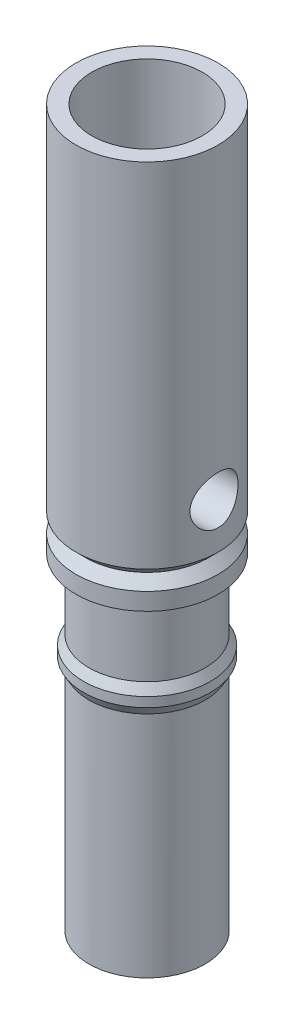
ISO-10303-21;
HEADER;
FILE_DESCRIPTION(('STEP AP214'),'2;1');
FILE_NAME('part.step','',(''),(''),'','','');
FILE_SCHEMA(('AUTOMOTIVE_DESIGN { 1 0 10303 214 1 1 1 1 }'));
ENDSEC;
DATA;
#1=APPLICATION_CONTEXT('core data for automotive mechanical design processes');
#2=APPLICATION_PROTOCOL_DEFINITION('international standard','automotive_design',2000,#1);
#3=PRODUCT_CONTEXT('',#1,'mechanical');
#4=PRODUCT('Part','Part','',(#3));
#5=PRODUCT_RELATED_PRODUCT_CATEGORY('part','',(#4));
#6=PRODUCT_DEFINITION_FORMATION('','',#4);
#7=PRODUCT_DEFINITION_CONTEXT('part definition',#1,'design');
#8=PRODUCT_DEFINITION('design','',#6,#7);
#9=PRODUCT_DEFINITION_SHAPE('','',#8);
#10=(LENGTH_UNIT() NAMED_UNIT(*) SI_UNIT(.MILLI.,.METRE.));
#11=(NAMED_UNIT(*) PLANE_ANGLE_UNIT() SI_UNIT($,.RADIAN.));
#12=(NAMED_UNIT(*) SI_UNIT($,.STERADIAN.) SOLID_ANGLE_UNIT());
#13=UNCERTAINTY_MEASURE_WITH_UNIT(LENGTH_MEASURE(1.E-05),#10,'distance_accuracy_value','');
#14=(GEOMETRIC_REPRESENTATION_CONTEXT(3) GLOBAL_UNCERTAINTY_ASSIGNED_CONTEXT((#13)) GLOBAL_UNIT_ASSIGNED_CONTEXT((#10,
#11,#12)) REPRESENTATION_CONTEXT('',''));
#15=CARTESIAN_POINT('',(0.,0.,0.));
#16=DIRECTION('',(0.,0.,1.));
#17=DIRECTION('',(1.,0.,0.));
#18=AXIS2_PLACEMENT_3D('',#15,#16,#17);
#19=CARTESIAN_POINT('',(0.,-4.29999999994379,0.));
#20=DIRECTION('',(0.,-1.,0.));
#21=DIRECTION('',(0.,0.,-1.));
#22=AXIS2_PLACEMENT_3D('',#19,#20,#21);
#23=CONICAL_SURFACE('',#22,0.409999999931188,1.04719755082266);
#24=CARTESIAN_POINT('',(-1.4210854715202E-10,-4.06328638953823,0.));
#25=VERTEX_POINT('',#24);
#26=VERTEX_LOOP('',#25);
#27=FACE_BOUND('',#26,.T.);
#28=CARTESIAN_POINT('',(0.,-4.3,0.));
#29=DIRECTION('',(0.,-1.,0.));
#30=DIRECTION('',(0.,0.,-1.));
#31=AXIS2_PLACEMENT_3D('',#28,#29,#30);
#32=CIRCLE('',#31,0.41);
#33=CARTESIAN_POINT('',(0.,-4.3,-0.41));
#34=VERTEX_POINT('',#33);
#35=EDGE_CURVE('E39',#34,#34,#32,.T.);
#36=ORIENTED_EDGE('',*,*,#35,.T.);
#37=EDGE_LOOP('',(#36));
#38=FACE_BOUND('',#37,.T.);
#39=ADVANCED_FACE('F19',(#27,#38),#23,.F.);
#40=CARTESIAN_POINT('',(0.,0.3725,0.));
#41=DIRECTION('',(0.,-1.,0.));
#42=DIRECTION('',(0.,0.,-1.));
#43=AXIS2_PLACEMENT_3D('',#40,#41,#42);
#44=CYLINDRICAL_SURFACE('',#43,0.41);
#45=ORIENTED_EDGE('',*,*,#35,.F.);
#46=EDGE_LOOP('',(#45));
#47=FACE_BOUND('',#46,.T.);
#48=CARTESIAN_POINT('',(0.,-7.20751288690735,0.));
#49=DIRECTION('',(0.,-1.,0.));
#50=DIRECTION('',(1.,0.,0.));
#51=AXIS2_PLACEMENT_3D('',#48,#49,#50);
#52=CIRCLE('',#51,0.409999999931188);
#53=CARTESIAN_POINT('',(0.409999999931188,-7.20751288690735,0.));
#54=VERTEX_POINT('',#53);
#55=EDGE_CURVE('E41',#54,#54,#52,.T.);
#56=ORIENTED_EDGE('',*,*,#55,.T.);
#57=EDGE_LOOP('',(#56));
#58=FACE_BOUND('',#57,.T.);
#59=ADVANCED_FACE('F36',(#47,#58),#44,.F.);
#60=CARTESIAN_POINT('',(0.,-7.44999999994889,0.));
#61=DIRECTION('',(0.,-1.,0.));
#62=DIRECTION('',(0.,0.,-1.));
#63=AXIS2_PLACEMENT_3D('',#60,#61,#62);
#64=CONICAL_SURFACE('',#63,0.549999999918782,0.523598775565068);
#65=ORIENTED_EDGE('',*,*,#55,.F.);
#66=EDGE_LOOP('',(#65));
#67=FACE_BOUND('',#66,.T.);
#68=CARTESIAN_POINT('',(0.,-7.45000000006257,0.));
#69=DIRECTION('',(0.,-1.,0.));
#70=DIRECTION('',(0.,0.,-1.));
#71=AXIS2_PLACEMENT_3D('',#68,#69,#70);
#72=CIRCLE('',#71,0.549999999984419);
#73=CARTESIAN_POINT('',(0.,-7.45000000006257,-0.549999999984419));
#74=VERTEX_POINT('',#73);
#75=EDGE_CURVE('E22',#74,#74,#72,.F.);
#76=ORIENTED_EDGE('',*,*,#75,.F.);
#77=EDGE_LOOP('',(#76));
#78=FACE_BOUND('',#77,.T.);
#79=ADVANCED_FACE('F177',(#67,#78),#64,.F.);
#80=CARTESIAN_POINT('',(0.,-7.45,0.));
#81=DIRECTION('',(0.,-1.,0.));
#82=DIRECTION('',(0.,0.,-1.));
#83=AXIS2_PLACEMENT_3D('',#80,#81,#82);
#84=PLANE('',#83);
#85=ORIENTED_EDGE('',*,*,#75,.T.);
#86=EDGE_LOOP('',(#85));
#87=FACE_BOUND('',#86,.T.);
#88=CARTESIAN_POINT('',(0.,-7.45,0.));
#89=DIRECTION('',(0.,-1.,0.));
#90=DIRECTION('',(0.,0.,-1.));
#91=AXIS2_PLACEMENT_3D('',#88,#89,#90);
#92=CIRCLE('',#91,0.605);
#93=CARTESIAN_POINT('',(0.,-7.45,-0.605));
#94=VERTEX_POINT('',#93);
#95=EDGE_CURVE('E108',#94,#94,#92,.F.);
#96=ORIENTED_EDGE('',*,*,#95,.F.);
#97=EDGE_LOOP('',(#96));
#98=FACE_BOUND('',#97,.T.);
#99=ADVANCED_FACE('F174',(#87,#98),#84,.T.);
#100=CARTESIAN_POINT('',(0.,0.3725,0.));
#101=DIRECTION('',(0.,-1.,0.));
#102=DIRECTION('',(0.,0.,-1.));
#103=AXIS2_PLACEMENT_3D('',#100,#101,#102);
#104=CYLINDRICAL_SURFACE('',#103,0.605);
#105=ORIENTED_EDGE('',*,*,#95,.T.);
#106=EDGE_LOOP('',(#105));
#107=FACE_BOUND('',#106,.T.);
#108=CARTESIAN_POINT('',(0.,-5.07026279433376,0.));
#109=DIRECTION('',(0.,1.,0.));
#110=DIRECTION('',(0.,0.,1.));
#111=AXIS2_PLACEMENT_3D('',#108,#109,#110);
#112=CIRCLE('',#111,0.605000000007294);
#113=CARTESIAN_POINT('',(0.,-5.07026279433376,0.605000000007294));
#114=VERTEX_POINT('',#113);
#115=EDGE_CURVE('E105',#114,#114,#112,.T.);
#116=ORIENTED_EDGE('',*,*,#115,.F.);
#117=EDGE_LOOP('',(#116));
#118=FACE_BOUND('',#117,.T.);
#119=ADVANCED_FACE('F170',(#107,#118),#104,.T.);
#120=CARTESIAN_POINT('',(0.,-4.97500000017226,0.));
#121=DIRECTION('',(0.,1.,0.));
#122=DIRECTION('',(0.,0.,1.));
#123=AXIS2_PLACEMENT_3D('',#120,#121,#122);
#124=CONICAL_SURFACE('',#123,0.659999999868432,0.523598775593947);
#125=CARTESIAN_POINT('',(0.,-4.975,0.));
#126=DIRECTION('',(0.,-1.,0.));
#127=DIRECTION('',(0.,0.,-1.));
#128=AXIS2_PLACEMENT_3D('',#125,#126,#127);
#129=CIRCLE('',#128,0.66);
#130=CARTESIAN_POINT('',(0.,-4.975,-0.66));
#131=VERTEX_POINT('',#130);
#132=EDGE_CURVE('E102',#131,#131,#129,.F.);
#133=ORIENTED_EDGE('',*,*,#132,.F.);
#134=EDGE_LOOP('',(#133));
#135=FACE_BOUND('',#134,.T.);
#136=ORIENTED_EDGE('',*,*,#115,.T.);
#137=EDGE_LOOP('',(#136));
#138=FACE_BOUND('',#137,.T.);
#139=ADVANCED_FACE('F166',(#135,#138),#124,.T.);
#140=CARTESIAN_POINT('',(0.,-4.765210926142,0.));
#141=DIRECTION('',(0.,-1.,0.));
#142=DIRECTION('',(0.,0.,-1.));
#143=AXIS2_PLACEMENT_3D('',#140,#141,#142);
#144=CYLINDRICAL_SURFACE('',#143,0.66);
#145=ORIENTED_EDGE('',*,*,#132,.T.);
#146=EDGE_LOOP('',(#145));
#147=FACE_BOUND('',#146,.T.);
#148=CARTESIAN_POINT('',(0.,-4.87499999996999,0.));
#149=DIRECTION('',(0.,-1.,0.));
#150=DIRECTION('',(0.,0.,-1.));
#151=AXIS2_PLACEMENT_3D('',#148,#149,#150);
#152=CIRCLE('',#151,0.660000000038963);
#153=CARTESIAN_POINT('',(0.,-4.87499999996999,-0.660000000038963));
#154=VERTEX_POINT('',#153);
#155=EDGE_CURVE('E101',#154,#154,#152,.F.);
#156=ORIENTED_EDGE('',*,*,#155,.F.);
#157=EDGE_LOOP('',(#156));
#158=FACE_BOUND('',#157,.T.);
#159=ADVANCED_FACE('F162',(#147,#158),#144,.T.);
#160=CARTESIAN_POINT('',(0.,-4.8749999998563,0.));
#161=DIRECTION('',(0.,-1.,0.));
#162=DIRECTION('',(0.,0.,-1.));
#163=AXIS2_PLACEMENT_3D('',#160,#161,#162);
#164=CONICAL_SURFACE('',#163,0.659999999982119,0.523598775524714);
#165=ORIENTED_EDGE('',*,*,#155,.T.);
#166=EDGE_LOOP('',(#165));
#167=FACE_BOUND('',#166,.T.);
#168=CARTESIAN_POINT('',(0.,-4.779737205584,0.));
#169=DIRECTION('',(0.,-1.,0.));
#170=DIRECTION('',(0.,0.,-1.));
#171=AXIS2_PLACEMENT_3D('',#168,#169,#170);
#172=CIRCLE('',#171,0.605);
#173=CARTESIAN_POINT('',(0.,-4.779737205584,-0.605));
#174=VERTEX_POINT('',#173);
#175=EDGE_CURVE('E97',#174,#174,#172,.F.);
#176=ORIENTED_EDGE('',*,*,#175,.F.);
#177=EDGE_LOOP('',(#176));
#178=FACE_BOUND('',#177,.T.);
#179=ADVANCED_FACE('F158',(#167,#178),#164,.T.);
#180=CARTESIAN_POINT('',(0.,0.3725,0.));
#181=DIRECTION('',(0.,-1.,0.));
#182=DIRECTION('',(0.,0.,-1.));
#183=AXIS2_PLACEMENT_3D('',#180,#181,#182);
#184=CYLINDRICAL_SURFACE('',#183,0.605);
#185=CARTESIAN_POINT('',(0.,-4.05,0.));
#186=DIRECTION('',(0.,-1.,0.));
#187=DIRECTION('',(0.,0.,-1.));
#188=AXIS2_PLACEMENT_3D('',#185,#186,#187);
#189=CIRCLE('',#188,0.605);
#190=CARTESIAN_POINT('',(0.,-4.05,-0.605));
#191=VERTEX_POINT('',#190);
#192=EDGE_CURVE('E100',#191,#191,#189,.F.);
#193=ORIENTED_EDGE('',*,*,#192,.F.);
#194=EDGE_LOOP('',(#193));
#195=FACE_BOUND('',#194,.T.);
#196=ORIENTED_EDGE('',*,*,#175,.T.);
#197=EDGE_LOOP('',(#196));
#198=FACE_BOUND('',#197,.T.);
#199=ADVANCED_FACE('F154',(#195,#198),#184,.T.);
#200=CARTESIAN_POINT('',(0.,-4.05,0.));
#201=DIRECTION('',(0.,-1.,0.));
#202=DIRECTION('',(0.,0.,-1.));
#203=AXIS2_PLACEMENT_3D('',#200,#201,#202);
#204=PLANE('',#203);
#205=ORIENTED_EDGE('',*,*,#192,.T.);
#206=EDGE_LOOP('',(#205));
#207=FACE_BOUND('',#206,.T.);
#208=CARTESIAN_POINT('',(0.,-4.05,0.));
#209=DIRECTION('',(0.,-1.,0.));
#210=DIRECTION('',(0.,0.,-1.));
#211=AXIS2_PLACEMENT_3D('',#208,#209,#210);
#212=CIRCLE('',#211,0.74);
#213=CARTESIAN_POINT('',(0.,-4.05,-0.74));
#214=VERTEX_POINT('',#213);
#215=EDGE_CURVE('E96',#214,#214,#212,.F.);
#216=ORIENTED_EDGE('',*,*,#215,.F.);
#217=EDGE_LOOP('',(#216));
#218=FACE_BOUND('',#217,.T.);
#219=ADVANCED_FACE('F150',(#207,#218),#204,.T.);
#220=CARTESIAN_POINT('',(0.,0.3725,0.));
#221=DIRECTION('',(0.,-1.,0.));
#222=DIRECTION('',(0.,0.,-1.));
#223=AXIS2_PLACEMENT_3D('',#220,#221,#222);
#224=CYLINDRICAL_SURFACE('',#223,0.74);
#225=ORIENTED_EDGE('',*,*,#215,.T.);
#226=EDGE_LOOP('',(#225));
#227=FACE_BOUND('',#226,.T.);
#228=CARTESIAN_POINT('',(0.,-3.87000000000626,0.));
#229=DIRECTION('',(0.,-1.,0.));
#230=DIRECTION('',(0.,0.,1.));
#231=AXIS2_PLACEMENT_3D('',#228,#229,#230);
#232=CIRCLE('',#231,0.740000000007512);
#233=CARTESIAN_POINT('',(0.,-3.87000000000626,0.740000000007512));
#234=VERTEX_POINT('',#233);
#235=EDGE_CURVE('E93',#234,#234,#232,.F.);
#236=ORIENTED_EDGE('',*,*,#235,.F.);
#237=EDGE_LOOP('',(#236));
#238=FACE_BOUND('',#237,.T.);
#239=ADVANCED_FACE('F146',(#227,#238),#224,.T.);
#240=CARTESIAN_POINT('',(0.,-1.50000000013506,0.));
#241=DIRECTION('',(0.,1.,0.));
#242=DIRECTION('',(0.,0.,1.));
#243=AXIS2_PLACEMENT_3D('',#240,#241,#242);
#244=CONICAL_SURFACE('',#243,0.57499999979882,1.04719755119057);
#245=CARTESIAN_POINT('',(0.,-1.62124355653,0.));
#246=DIRECTION('',(0.,-1.,0.));
#247=DIRECTION('',(0.,0.,-1.));
#248=AXIS2_PLACEMENT_3D('',#245,#246,#247);
#249=CIRCLE('',#248,0.365);
#250=CARTESIAN_POINT('',(0.,-1.62124355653,-0.365));
#251=VERTEX_POINT('',#250);
#252=EDGE_CURVE('E90',#251,#251,#249,.T.);
#253=ORIENTED_EDGE('',*,*,#252,.T.);
#254=EDGE_LOOP('',(#253));
#255=FACE_BOUND('',#254,.T.);
#256=CARTESIAN_POINT('',(0.,-1.5,0.));
#257=DIRECTION('',(0.,-1.,0.));
#258=DIRECTION('',(0.,0.,-1.));
#259=AXIS2_PLACEMENT_3D('',#256,#257,#258);
#260=CIRCLE('',#259,0.575);
#261=CARTESIAN_POINT('',(0.,-1.5,-0.575));
#262=VERTEX_POINT('',#261);
#263=EDGE_CURVE('E87',#262,#262,#260,.F.);
#264=ORIENTED_EDGE('',*,*,#263,.T.);
#265=EDGE_LOOP('',(#264));
#266=FACE_BOUND('',#265,.T.);
#267=ADVANCED_FACE('F142',(#255,#266),#244,.F.);
#268=CARTESIAN_POINT('',(0.,-3.87000000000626,0.));
#269=DIRECTION('',(0.,-1.,0.));
#270=DIRECTION('',(0.,0.,-1.));
#271=AXIS2_PLACEMENT_3D('',#268,#269,#270);
#272=CONICAL_SURFACE('',#271,0.740000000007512,0.785398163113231);
#273=CARTESIAN_POINT('',(0.,-3.76999999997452,0.));
#274=DIRECTION('',(0.,1.,0.));
#275=DIRECTION('',(0.,0.,-1.));
#276=AXIS2_PLACEMENT_3D('',#273,#274,#275);
#277=CIRCLE('',#276,0.640000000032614);
#278=CARTESIAN_POINT('',(0.,-3.76999999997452,-0.640000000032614));
#279=VERTEX_POINT('',#278);
#280=EDGE_CURVE('E84',#279,#279,#277,.T.);
#281=ORIENTED_EDGE('',*,*,#280,.F.);
#282=EDGE_LOOP('',(#281));
#283=FACE_BOUND('',#282,.T.);
#284=ORIENTED_EDGE('',*,*,#235,.T.);
#285=EDGE_LOOP('',(#284));
#286=FACE_BOUND('',#285,.T.);
#287=ADVANCED_FACE('F138',(#283,#286),#272,.T.);
#288=CARTESIAN_POINT('',(0.,-3.64999999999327,0.));
#289=DIRECTION('',(0.,1.,0.));
#290=DIRECTION('',(0.,0.,1.));
#291=AXIS2_PLACEMENT_3D('',#288,#289,#290);
#292=CONICAL_SURFACE('',#291,0.364999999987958,1.04719755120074);
#293=CARTESIAN_POINT('',(0.,-3.65,0.));
#294=DIRECTION('',(0.,-1.,0.));
#295=DIRECTION('',(0.,0.,-1.));
#296=AXIS2_PLACEMENT_3D('',#293,#294,#295);
#297=CIRCLE('',#296,0.365);
#298=CARTESIAN_POINT('',(0.,-3.65,-0.365));
#299=VERTEX_POINT('',#298);
#300=EDGE_CURVE('E79',#299,#299,#297,.F.);
#301=ORIENTED_EDGE('',*,*,#300,.T.);
#302=EDGE_LOOP('',(#301));
#303=FACE_BOUND('',#302,.T.);
#304=CARTESIAN_POINT('',(0.,-3.86073284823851,0.));
#305=VERTEX_POINT('',#304);
#306=VERTEX_LOOP('',#305);
#307=FACE_BOUND('',#306,.T.);
#308=ADVANCED_FACE('F134',(#303,#307),#292,.F.);
#309=CARTESIAN_POINT('',(0.,0.3725,0.));
#310=DIRECTION('',(0.,-1.,0.));
#311=DIRECTION('',(0.,0.,-1.));
#312=AXIS2_PLACEMENT_3D('',#309,#310,#311);
#313=CYLINDRICAL_SURFACE('',#312,0.575);
#314=ORIENTED_EDGE('',*,*,#263,.F.);
#315=EDGE_LOOP('',(#314));
#316=FACE_BOUND('',#315,.T.);
#317=CARTESIAN_POINT('',(0.,0.,0.));
#318=DIRECTION('',(0.,-1.,0.));
#319=DIRECTION('',(0.,0.,-1.));
#320=AXIS2_PLACEMENT_3D('',#317,#318,#319);
#321=CIRCLE('',#320,0.575);
#322=CARTESIAN_POINT('',(0.,0.,-0.575));
#323=VERTEX_POINT('',#322);
#324=EDGE_CURVE('E75',#323,#323,#321,.F.);
#325=ORIENTED_EDGE('',*,*,#324,.T.);
#326=EDGE_LOOP('',(#325));
#327=FACE_BOUND('',#326,.T.);
#328=ADVANCED_FACE('F130',(#316,#327),#313,.F.);
#329=CARTESIAN_POINT('',(0.,-3.67000000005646,0.));
#330=DIRECTION('',(0.,1.,0.));
#331=DIRECTION('',(-1.,0.,0.));
#332=AXIS2_PLACEMENT_3D('',#329,#330,#331);
#333=CONICAL_SURFACE('',#332,0.740000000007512,0.785398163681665);
#334=ORIENTED_EDGE('',*,*,#280,.T.);
#335=EDGE_LOOP('',(#334));
#336=FACE_BOUND('',#335,.T.);
#337=CARTESIAN_POINT('',(0.,-3.67,0.));
#338=DIRECTION('',(0.,-1.,0.));
#339=DIRECTION('',(0.,0.,-1.));
#340=AXIS2_PLACEMENT_3D('',#337,#338,#339);
#341=CIRCLE('',#340,0.74);
#342=CARTESIAN_POINT('',(0.,-3.67,-0.74));
#343=VERTEX_POINT('',#342);
#344=EDGE_CURVE('E72',#343,#343,#341,.F.);
#345=ORIENTED_EDGE('',*,*,#344,.F.);
#346=EDGE_LOOP('',(#345));
#347=FACE_BOUND('',#346,.T.);
#348=ADVANCED_FACE('F126',(#336,#347),#333,.T.);
#349=CARTESIAN_POINT('',(0.,0.3725,0.));
#350=DIRECTION('',(0.,-1.,0.));
#351=DIRECTION('',(0.,0.,-1.));
#352=AXIS2_PLACEMENT_3D('',#349,#350,#351);
#353=CYLINDRICAL_SURFACE('',#352,0.365);
#354=ORIENTED_EDGE('',*,*,#252,.F.);
#355=EDGE_LOOP('',(#354));
#356=FACE_BOUND('',#355,.T.);
#357=ORIENTED_EDGE('',*,*,#300,.F.);
#358=EDGE_LOOP('',(#357));
#359=FACE_BOUND('',#358,.T.);
#360=CARTESIAN_POINT('',(0.26594172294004,-3.19999999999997,0.250000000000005));
#361=CARTESIAN_POINT('',(0.265945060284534,-3.21207499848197,0.249998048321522));
#362=CARTESIAN_POINT('',(0.266781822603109,-3.2241696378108,0.249115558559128));
#363=CARTESIAN_POINT('',(0.269965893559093,-3.24792837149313,0.245659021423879));
#364=CARTESIAN_POINT('',(0.272318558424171,-3.2595907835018,0.243078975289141));
#365=CARTESIAN_POINT('',(0.278099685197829,-3.28204342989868,0.236441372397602));
#366=CARTESIAN_POINT('',(0.281516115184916,-3.29284179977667,0.232400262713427));
#367=CARTESIAN_POINT('',(0.289019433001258,-3.31358206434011,0.222999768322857));
#368=CARTESIAN_POINT('',(0.293106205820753,-3.32352410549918,0.217640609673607));
#369=CARTESIAN_POINT('',(0.302302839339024,-3.34408373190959,0.204721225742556));
#370=CARTESIAN_POINT('',(0.307469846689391,-3.35453893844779,0.19694321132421));
#371=CARTESIAN_POINT('',(0.317773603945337,-3.37413928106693,0.179846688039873));
#372=CARTESIAN_POINT('',(0.322910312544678,-3.38328290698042,0.170526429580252));
#373=CARTESIAN_POINT('',(0.333516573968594,-3.40142139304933,0.148858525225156));
#374=CARTESIAN_POINT('',(0.33891292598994,-3.41017024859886,0.136265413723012));
#375=CARTESIAN_POINT('',(0.3485279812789,-3.42534668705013,0.109346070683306));
#376=CARTESIAN_POINT('',(0.352748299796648,-3.43177745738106,0.0950222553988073));
#377=CARTESIAN_POINT('',(0.358967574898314,-3.44112830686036,0.0673538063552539));
#378=CARTESIAN_POINT('',(0.361207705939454,-3.44443514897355,0.0541950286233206));
#379=CARTESIAN_POINT('',(0.364222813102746,-3.4488694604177,0.0273559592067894));
#380=CARTESIAN_POINT('',(0.36499945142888,-3.44999940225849,0.0136762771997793));
#381=CARTESIAN_POINT('',(0.365000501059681,-3.45000054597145,-0.0124917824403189));
#382=CARTESIAN_POINT('',(0.364353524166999,-3.44905890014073,-0.0249807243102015));
#383=CARTESIAN_POINT('',(0.361831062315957,-3.44535393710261,-0.0495574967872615));
#384=CARTESIAN_POINT('',(0.359955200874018,-3.44259006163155,-0.0616452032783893));
#385=CARTESIAN_POINT('',(0.355158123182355,-3.43541314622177,-0.0850276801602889));
#386=CARTESIAN_POINT('',(0.352241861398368,-3.43100791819,-0.0963259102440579));
#387=CARTESIAN_POINT('',(0.34559493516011,-3.42074001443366,-0.117972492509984));
#388=CARTESIAN_POINT('',(0.341864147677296,-3.41487711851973,-0.128320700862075));
#389=CARTESIAN_POINT('',(0.333495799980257,-3.40130946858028,-0.148788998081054));
#390=CARTESIAN_POINT('',(0.328807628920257,-3.39348897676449,-0.158811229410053));
#391=CARTESIAN_POINT('',(0.319112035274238,-3.37651087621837,-0.17749236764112));
#392=CARTESIAN_POINT('',(0.314104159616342,-3.36735134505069,-0.186149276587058));
#393=CARTESIAN_POINT('',(0.303309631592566,-3.34618008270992,-0.203340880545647));
#394=CARTESIAN_POINT('',(0.29753311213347,-3.33394760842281,-0.211611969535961));
#395=CARTESIAN_POINT('',(0.286771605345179,-3.30794494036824,-0.225981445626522));
#396=CARTESIAN_POINT('',(0.281785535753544,-3.29417689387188,-0.232082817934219));
#397=CARTESIAN_POINT('',(0.27472110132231,-3.26958025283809,-0.240361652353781));
#398=CARTESIAN_POINT('',(0.272218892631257,-3.25908501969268,-0.243165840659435));
#399=CARTESIAN_POINT('',(0.268386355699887,-3.23763128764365,-0.247390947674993));
#400=CARTESIAN_POINT('',(0.2670517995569,-3.22667461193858,-0.248816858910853));
#401=CARTESIAN_POINT('',(0.266094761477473,-3.2104421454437,-0.249836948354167));
#402=CARTESIAN_POINT('',(0.265940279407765,-3.2052229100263,-0.25000084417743));
#403=CARTESIAN_POINT('',(0.265945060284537,-3.18792500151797,-0.249998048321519));
#404=CARTESIAN_POINT('',(0.266781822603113,-3.17583036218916,-0.249115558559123));
#405=CARTESIAN_POINT('',(0.269965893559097,-3.15207162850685,-0.245659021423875));
#406=CARTESIAN_POINT('',(0.272318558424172,-3.14040921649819,-0.243078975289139));
#407=CARTESIAN_POINT('',(0.278099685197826,-3.11795657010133,-0.236441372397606));
#408=CARTESIAN_POINT('',(0.281516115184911,-3.10715820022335,-0.232400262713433));
#409=CARTESIAN_POINT('',(0.289019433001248,-3.08641793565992,-0.22299976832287));
#410=CARTESIAN_POINT('',(0.29310620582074,-3.07647589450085,-0.217640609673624));
#411=CARTESIAN_POINT('',(0.302302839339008,-3.05591626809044,-0.20472122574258));
#412=CARTESIAN_POINT('',(0.307469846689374,-3.04546106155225,-0.196943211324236));
#413=CARTESIAN_POINT('',(0.317773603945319,-3.02586071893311,-0.179846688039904));
#414=CARTESIAN_POINT('',(0.32291031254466,-3.01671709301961,-0.170526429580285));
#415=CARTESIAN_POINT('',(0.333516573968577,-2.9985786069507,-0.148858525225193));
#416=CARTESIAN_POINT('',(0.338912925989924,-2.98982975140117,-0.136265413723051));
#417=CARTESIAN_POINT('',(0.348527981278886,-2.97465331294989,-0.10934607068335));
#418=CARTESIAN_POINT('',(0.352748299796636,-2.96822254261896,-0.0950222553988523));
#419=CARTESIAN_POINT('',(0.358967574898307,-2.95887169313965,-0.0673538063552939));
#420=CARTESIAN_POINT('',(0.361207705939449,-2.95556485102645,-0.0541950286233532));
#421=CARTESIAN_POINT('',(0.364222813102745,-2.9511305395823,-0.0273559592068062));
#422=CARTESIAN_POINT('',(0.36499945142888,-2.95000059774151,-0.0136762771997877));
#423=CARTESIAN_POINT('',(0.365000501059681,-2.94999945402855,0.0124917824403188));
#424=CARTESIAN_POINT('',(0.364353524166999,-2.95094109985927,0.0249807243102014));
#425=CARTESIAN_POINT('',(0.361831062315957,-2.95464606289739,0.0495574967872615));
#426=CARTESIAN_POINT('',(0.359955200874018,-2.95740993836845,0.0616452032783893));
#427=CARTESIAN_POINT('',(0.355158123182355,-2.96458685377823,0.0850276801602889));
#428=CARTESIAN_POINT('',(0.352241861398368,-2.96899208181,0.096325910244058));
#429=CARTESIAN_POINT('',(0.34559493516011,-2.97925998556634,0.117972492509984));
#430=CARTESIAN_POINT('',(0.341864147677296,-2.98512288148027,0.128320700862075));
#431=CARTESIAN_POINT('',(0.333495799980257,-2.99869053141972,0.148788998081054));
#432=CARTESIAN_POINT('',(0.328807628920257,-3.00651102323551,0.158811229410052));
#433=CARTESIAN_POINT('',(0.319112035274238,-3.02348912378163,0.17749236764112));
#434=CARTESIAN_POINT('',(0.314104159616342,-3.03264865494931,0.186149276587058));
#435=CARTESIAN_POINT('',(0.303309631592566,-3.05381991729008,0.203340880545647));
#436=CARTESIAN_POINT('',(0.29753311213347,-3.06605239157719,0.211611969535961));
#437=CARTESIAN_POINT('',(0.286771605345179,-3.09205505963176,0.225981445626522));
#438=CARTESIAN_POINT('',(0.281785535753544,-3.10582310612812,0.232082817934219));
#439=CARTESIAN_POINT('',(0.274721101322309,-3.13041974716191,0.240361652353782));
#440=CARTESIAN_POINT('',(0.272218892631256,-3.14091498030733,0.243165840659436));
#441=CARTESIAN_POINT('',(0.268386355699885,-3.16236871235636,0.247390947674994));
#442=CARTESIAN_POINT('',(0.267051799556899,-3.17332538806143,0.248816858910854));
#443=CARTESIAN_POINT('',(0.266094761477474,-3.18955785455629,0.249836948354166));
#444=CARTESIAN_POINT('',(0.265940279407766,-3.19477708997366,0.250000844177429));
#445=CARTESIAN_POINT('',(0.26594172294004,-3.19999999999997,0.250000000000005));
#446=B_SPLINE_CURVE_WITH_KNOTS('',3,(#360,#361,#362,#363,#364,#365,#366,#367,#368,#369,#370,
#371,#372,#373,#374,#375,#376,#377,#378,#379,#380,#381,#382,#383,#384,#385,#386,#387,#388,#389,
#390,#391,#392,#393,#394,#395,#396,#397,#398,#399,#400,#401,#402,#403,#404,#405,#406,#407,#408,
#409,#410,#411,#412,#413,#414,#415,#416,#417,#418,#419,#420,#421,#422,#423,#424,#425,#426,#427,
#428,#429,#430,#431,#432,#433,#434,#435,#436,#437,#438,#439,#440,#441,#442,#443,#444,#445),
.UNSPECIFIED.,.T.,.F.,(4,2,2,2,2,2,2,2,2,2,2,2,2,2,2,2,2,2,2,2,2,2,2,2,2,2,2,2,2,2,2,2,2,2,2,2,
2,2,2,2,2,2,4),(0.,0.0362039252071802,0.0725364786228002,0.10847216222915,0.144401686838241,
0.186303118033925,0.228252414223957,0.276749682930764,0.325180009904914,0.366195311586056,
0.407164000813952,0.444584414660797,0.482016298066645,0.519272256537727,0.556533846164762,
0.597031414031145,0.637587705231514,0.684940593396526,0.732228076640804,0.765544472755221,
0.798739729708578,0.814399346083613,0.850603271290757,0.886935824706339,0.922871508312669,
0.958801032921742,1.00070246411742,1.04265176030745,1.09114902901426,1.13957935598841,
1.18059465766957,1.2215633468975,1.25898376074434,1.29641564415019,1.33367160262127,
1.37093319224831,1.41143076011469,1.45198705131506,1.49933993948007,1.54662742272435,
1.57994381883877,1.61313907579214,1.62879869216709),.UNSPECIFIED.);
#447=CARTESIAN_POINT('',(0.26594172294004,-3.19999999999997,0.250000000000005));
#448=VERTEX_POINT('',#447);
#449=EDGE_CURVE('E74',#448,#448,#446,.T.);
#450=ORIENTED_EDGE('',*,*,#449,.T.);
#451=EDGE_LOOP('',(#450));
#452=FACE_BOUND('',#451,.T.);
#453=ADVANCED_FACE('F122',(#356,#359,#452),#353,.F.);
#454=CARTESIAN_POINT('',(0.,0.,0.));
#455=DIRECTION('',(0.,-1.,0.));
#456=DIRECTION('',(0.,0.,-1.));
#457=AXIS2_PLACEMENT_3D('',#454,#455,#456);
#458=PLANE('',#457);
#459=ORIENTED_EDGE('',*,*,#324,.F.);
#460=EDGE_LOOP('',(#459));
#461=FACE_BOUND('',#460,.T.);
#462=CARTESIAN_POINT('',(0.,0.,0.));
#463=DIRECTION('',(0.,-1.,0.));
#464=DIRECTION('',(0.,0.,-1.));
#465=AXIS2_PLACEMENT_3D('',#462,#463,#464);
#466=CIRCLE('',#465,0.74);
#467=CARTESIAN_POINT('',(0.,0.,-0.74));
#468=VERTEX_POINT('',#467);
#469=EDGE_CURVE('E28',#468,#468,#466,.T.);
#470=ORIENTED_EDGE('',*,*,#469,.F.);
#471=EDGE_LOOP('',(#470));
#472=FACE_BOUND('',#471,.T.);
#473=ADVANCED_FACE('F63',(#461,#472),#458,.F.);
#474=CARTESIAN_POINT('',(0.75,-3.2,0.));
#475=DIRECTION('',(1.,0.,0.));
#476=DIRECTION('',(0.,0.,-1.));
#477=AXIS2_PLACEMENT_3D('',#474,#475,#476);
#478=CYLINDRICAL_SURFACE('',#477,0.25);
#479=ORIENTED_EDGE('',*,*,#449,.F.);
#480=EDGE_LOOP('',(#479));
#481=FACE_BOUND('',#480,.T.);
#482=CARTESIAN_POINT('',(0.74,-2.95,0.));
#483=CARTESIAN_POINT('',(0.739999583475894,-2.95000056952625,-0.0136207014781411));
#484=CARTESIAN_POINT('',(0.739620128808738,-2.95111762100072,-0.0272481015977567));
#485=CARTESIAN_POINT('',(0.73814209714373,-2.95554558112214,-0.0541079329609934));
#486=CARTESIAN_POINT('',(0.737042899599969,-2.95885838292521,-0.0673400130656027));
#487=CARTESIAN_POINT('',(0.734245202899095,-2.96755035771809,-0.0930074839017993));
#488=CARTESIAN_POINT('',(0.732547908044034,-2.97292538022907,-0.105444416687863));
#489=CARTESIAN_POINT('',(0.728726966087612,-2.98557234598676,-0.129237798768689));
#490=CARTESIAN_POINT('',(0.726603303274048,-2.99284435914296,-0.140594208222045));
#491=CARTESIAN_POINT('',(0.722068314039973,-3.00934977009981,-0.162309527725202));
#492=CARTESIAN_POINT('',(0.719649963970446,-3.01863841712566,-0.172624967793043));
#493=CARTESIAN_POINT('',(0.714835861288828,-3.03879832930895,-0.191587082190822));
#494=CARTESIAN_POINT('',(0.712440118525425,-3.04967025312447,-0.200233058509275));
#495=CARTESIAN_POINT('',(0.70786432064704,-3.07308471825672,-0.215862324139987));
#496=CARTESIAN_POINT('',(0.705692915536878,-3.08566765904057,-0.222787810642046));
#497=CARTESIAN_POINT('',(0.70192202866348,-3.11189758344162,-0.234399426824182));
#498=CARTESIAN_POINT('',(0.700321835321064,-3.12554321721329,-0.239088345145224));
#499=CARTESIAN_POINT('',(0.698259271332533,-3.14937466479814,-0.245031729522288));
#500=CARTESIAN_POINT('',(0.697600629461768,-3.15939666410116,-0.246890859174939));
#501=CARTESIAN_POINT('',(0.696716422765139,-3.17961118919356,-0.249375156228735));
#502=CARTESIAN_POINT('',(0.696490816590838,-3.18980369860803,-0.250000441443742));
#503=CARTESIAN_POINT('',(0.696491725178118,-3.21359572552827,-0.2499994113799));
#504=CARTESIAN_POINT('',(0.696894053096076,-3.22719819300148,-0.248886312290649));
#505=CARTESIAN_POINT('',(0.698453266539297,-3.25400611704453,-0.244475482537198));
#506=CARTESIAN_POINT('',(0.699610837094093,-3.26721120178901,-0.241175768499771));
#507=CARTESIAN_POINT('',(0.702534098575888,-3.29282135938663,-0.232522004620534));
#508=CARTESIAN_POINT('',(0.704298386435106,-3.3052282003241,-0.227172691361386));
#509=CARTESIAN_POINT('',(0.708234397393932,-3.32897014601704,-0.214586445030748));
#510=CARTESIAN_POINT('',(0.710406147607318,-3.34030517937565,-0.20734938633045));
#511=CARTESIAN_POINT('',(0.715010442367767,-3.36204000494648,-0.190881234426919));
#512=CARTESIAN_POINT('',(0.717449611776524,-3.37239057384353,-0.181587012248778));
#513=CARTESIAN_POINT('',(0.722258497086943,-3.39142179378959,-0.161400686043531));
#514=CARTESIAN_POINT('',(0.724628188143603,-3.40010185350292,-0.150508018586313));
#515=CARTESIAN_POINT('',(0.729108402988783,-3.41577087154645,-0.127070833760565));
#516=CARTESIAN_POINT('',(0.731210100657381,-3.42270727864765,-0.11448938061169));
#517=CARTESIAN_POINT('',(0.73483620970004,-3.4343395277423,-0.0882622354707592));
#518=CARTESIAN_POINT('',(0.736361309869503,-3.43903804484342,-0.0746178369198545));
#519=CARTESIAN_POINT('',(0.738323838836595,-3.4450047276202,-0.0507620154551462));
#520=CARTESIAN_POINT('',(0.738948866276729,-3.44687406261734,-0.0407123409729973));
#521=CARTESIAN_POINT('',(0.739787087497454,-3.44937186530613,-0.0204430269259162));
#522=CARTESIAN_POINT('',(0.740000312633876,-3.45000042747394,-0.0102234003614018));
#523=CARTESIAN_POINT('',(0.739999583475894,-3.44999943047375,0.013620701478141));
#524=CARTESIAN_POINT('',(0.739620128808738,-3.44888237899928,0.0272481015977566));
#525=CARTESIAN_POINT('',(0.73814209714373,-3.44445441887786,0.0541079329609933));
#526=CARTESIAN_POINT('',(0.737042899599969,-3.44114161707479,0.0673400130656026));
#527=CARTESIAN_POINT('',(0.734245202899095,-3.43244964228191,0.0930074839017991));
#528=CARTESIAN_POINT('',(0.732547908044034,-3.42707461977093,0.105444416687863));
#529=CARTESIAN_POINT('',(0.728726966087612,-3.41442765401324,0.129237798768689));
#530=CARTESIAN_POINT('',(0.726603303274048,-3.40715564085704,0.140594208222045));
#531=CARTESIAN_POINT('',(0.722068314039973,-3.39065022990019,0.162309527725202));
#532=CARTESIAN_POINT('',(0.719649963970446,-3.38136158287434,0.172624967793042));
#533=CARTESIAN_POINT('',(0.714835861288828,-3.36120167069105,0.191587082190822));
#534=CARTESIAN_POINT('',(0.712440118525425,-3.35032974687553,0.200233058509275));
#535=CARTESIAN_POINT('',(0.70786432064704,-3.32691528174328,0.215862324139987));
#536=CARTESIAN_POINT('',(0.705692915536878,-3.31433234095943,0.222787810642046));
#537=CARTESIAN_POINT('',(0.70192202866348,-3.28810241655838,0.234399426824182));
#538=CARTESIAN_POINT('',(0.700321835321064,-3.27445678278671,0.239088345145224));
#539=CARTESIAN_POINT('',(0.698259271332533,-3.25062533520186,0.245031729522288));
#540=CARTESIAN_POINT('',(0.697600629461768,-3.24060333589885,0.246890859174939));
#541=CARTESIAN_POINT('',(0.696716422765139,-3.22038881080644,0.249375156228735));
#542=CARTESIAN_POINT('',(0.696490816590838,-3.21019630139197,0.250000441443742));
#543=CARTESIAN_POINT('',(0.696491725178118,-3.18640427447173,0.2499994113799));
#544=CARTESIAN_POINT('',(0.696894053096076,-3.17280180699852,0.248886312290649));
#545=CARTESIAN_POINT('',(0.698453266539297,-3.14599388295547,0.244475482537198));
#546=CARTESIAN_POINT('',(0.699610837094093,-3.13278879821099,0.241175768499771));
#547=CARTESIAN_POINT('',(0.702534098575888,-3.10717864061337,0.232522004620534));
#548=CARTESIAN_POINT('',(0.704298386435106,-3.0947717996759,0.227172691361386));
#549=CARTESIAN_POINT('',(0.708234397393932,-3.07102985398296,0.214586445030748));
#550=CARTESIAN_POINT('',(0.710406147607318,-3.05969482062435,0.20734938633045));
#551=CARTESIAN_POINT('',(0.715010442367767,-3.03795999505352,0.190881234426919));
#552=CARTESIAN_POINT('',(0.717449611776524,-3.02760942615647,0.181587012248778));
#553=CARTESIAN_POINT('',(0.722258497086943,-3.00857820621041,0.161400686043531));
#554=CARTESIAN_POINT('',(0.724628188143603,-2.99989814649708,0.150508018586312));
#555=CARTESIAN_POINT('',(0.729108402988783,-2.98422912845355,0.127070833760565));
#556=CARTESIAN_POINT('',(0.731210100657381,-2.97729272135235,0.114489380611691));
#557=CARTESIAN_POINT('',(0.73483620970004,-2.9656604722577,0.0882622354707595));
#558=CARTESIAN_POINT('',(0.736361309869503,-2.96096195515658,0.0746178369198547));
#559=CARTESIAN_POINT('',(0.738323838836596,-2.9549952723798,0.0507620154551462));
#560=CARTESIAN_POINT('',(0.738948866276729,-2.95312593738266,0.0407123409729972));
#561=CARTESIAN_POINT('',(0.739787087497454,-2.95062813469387,0.0204430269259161));
#562=CARTESIAN_POINT('',(0.740000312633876,-2.94999957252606,0.0102234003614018));
#563=CARTESIAN_POINT('',(0.74,-2.95,0.));
#564=B_SPLINE_CURVE_WITH_KNOTS('',3,(#482,#483,#484,#485,#486,#487,#488,#489,#490,#491,#492,
#493,#494,#495,#496,#497,#498,#499,#500,#501,#502,#503,#504,#505,#506,#507,#508,#509,#510,#511,
#512,#513,#514,#515,#516,#517,#518,#519,#520,#521,#522,#523,#524,#525,#526,#527,#528,#529,#530,
#531,#532,#533,#534,#535,#536,#537,#538,#539,#540,#541,#542,#543,#544,#545,#546,#547,#548,#549,
#550,#551,#552,#553,#554,#555,#556,#557,#558,#559,#560,#561,#562,#563),.UNSPECIFIED.,.T.,.F.,(4,
2,2,2,2,2,2,2,2,2,2,2,2,2,2,2,2,2,2,2,2,2,2,2,2,2,2,2,2,2,2,2,2,2,2,2,2,2,2,2,4),(0.,
0.0408236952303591,0.0816826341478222,0.12245976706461,0.163238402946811,0.205320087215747,
0.247419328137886,0.290784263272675,0.334094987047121,0.364657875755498,0.395217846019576,
0.435966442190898,0.476752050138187,0.51744396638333,0.558138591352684,0.600318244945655,
0.642512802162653,0.685857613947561,0.72915048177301,0.759794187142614,0.790435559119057,
0.831259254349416,0.872118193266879,0.912895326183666,0.953673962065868,0.995755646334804,
1.03785488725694,1.08121982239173,1.12453054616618,1.15509343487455,1.18565340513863,
1.22640200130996,1.26718760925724,1.30787952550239,1.34857415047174,1.39075380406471,
1.43294836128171,1.47629317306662,1.51958604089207,1.55022974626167,1.58087111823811),.UNSPECIFIED.);
#565=CARTESIAN_POINT('',(0.74,-2.95,0.));
#566=VERTEX_POINT('',#565);
#567=EDGE_CURVE('E11',#566,#566,#564,.T.);
#568=ORIENTED_EDGE('',*,*,#567,.F.);
#569=EDGE_LOOP('',(#568));
#570=FACE_BOUND('',#569,.T.);
#571=ADVANCED_FACE('F52',(#481,#570),#478,.F.);
#572=CARTESIAN_POINT('',(0.,0.3725,0.));
#573=DIRECTION('',(0.,-1.,0.));
#574=DIRECTION('',(0.,0.,-1.));
#575=AXIS2_PLACEMENT_3D('',#572,#573,#574);
#576=CYLINDRICAL_SURFACE('',#575,0.74);
#577=ORIENTED_EDGE('',*,*,#567,.T.);
#578=EDGE_LOOP('',(#577));
#579=FACE_BOUND('',#578,.T.);
#580=ORIENTED_EDGE('',*,*,#469,.T.);
#581=EDGE_LOOP('',(#580));
#582=FACE_BOUND('',#581,.T.);
#583=ORIENTED_EDGE('',*,*,#344,.T.);
#584=EDGE_LOOP('',(#583));
#585=FACE_BOUND('',#584,.T.);
#586=ADVANCED_FACE('F55',(#579,#582,#585),#576,.T.);
#587=CLOSED_SHELL('',(#39,#59,#79,#99,#119,#139,#159,#179,#199,#219,#239,#267,#287,#308,#328,
#348,#453,#473,#571,#586));
#588=MANIFOLD_SOLID_BREP('B1',#587);
#589=ADVANCED_BREP_SHAPE_REPRESENTATION('',(#18,#588),#14);
#590=SHAPE_DEFINITION_REPRESENTATION(#9,#589);
ENDSEC;
END-ISO-10303-21;
